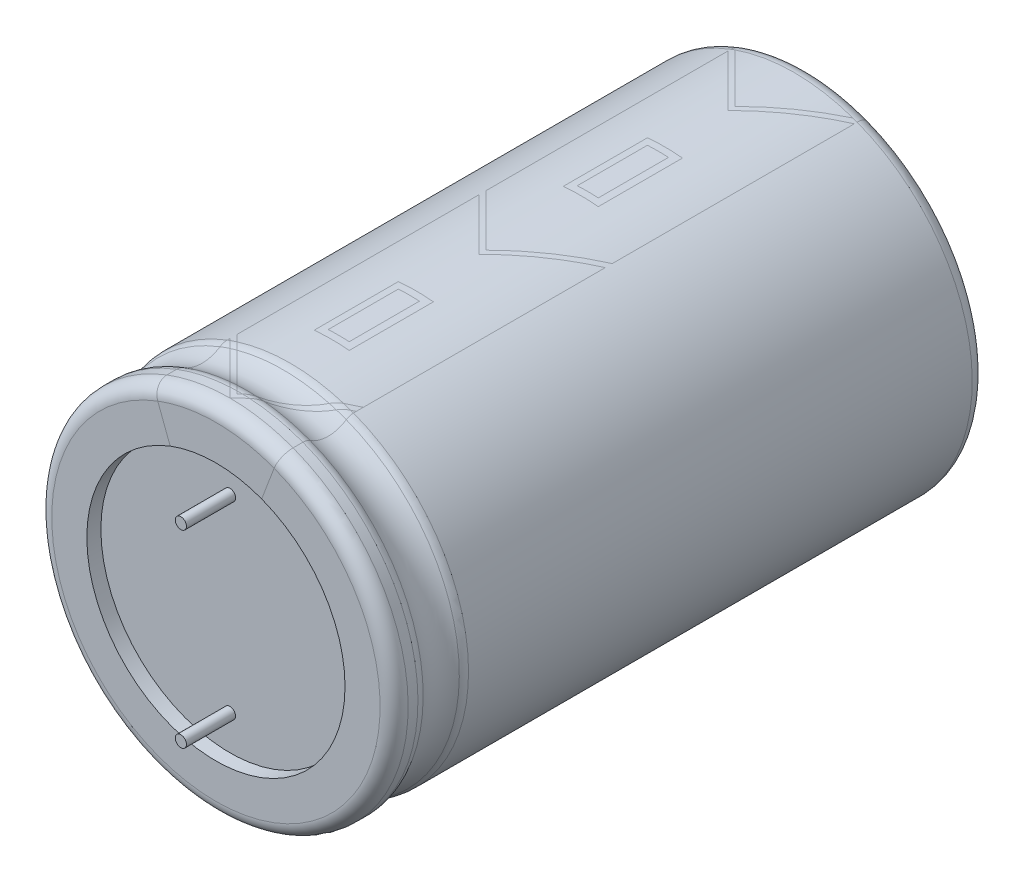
from build123d import *

# Parameters (mm, degrees)
SZKIC2_R                    = 9.2
WYTNIJ_WYCI_GNI_CIE1_DEPTH  = 1
DODANIE_WYCI_GNI_CIE1_START = 0.9
SZKIC3_R                    = 9.2
DODANIE_WYCI_GNI_CIE1_DEPTH = 0.9
WYTNIJ_WYCI_GNI_CIE2_START  = -1
SZKIC4_R                    = 9.2
WYTNIJ_WYCI_GNI_CIE2_DEPTH  = 1
SZKIC5_W                    = 0.2
SZKIC5_H                    = 9
WYTNIJ_WYCI_GNI_CIE3_DEPTH  = 0.2
SZYK_KO_OWY1_COUNT          = 4
SZKIC14_R                   = 0.4
DODANIE_WYCI_GNI_CIE2_DEPTH = 3.5


with BuildPart() as part:
    # Szkic1 → Obr_t1 (revolve)
    with BuildSketch(Plane(origin=(0, 0, 0), x_dir=(1, 0, 0), z_dir=(0, 1, 0))):
        with BuildLine():
            Line((0, 0), (0, 42.2))
            Line((0, 42.2), (11.7, 42.2))
            ThreePointArc((11.7, 42.2), (12.407106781, 41.907106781), (12.7, 41.2))
            Line((12.7, 41.2), (12.7, 5.302775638))
            ThreePointArc((12.7, 5.302775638), (12.663624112, 5.035514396), (12.557142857, 4.787696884))
            ThreePointArc((12.557142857, 4.787696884), (12.2, 3.5), (12.557142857, 2.212303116))
            ThreePointArc((12.557142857, 2.212303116), (12.663624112, 1.964485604), (12.7, 1.697224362))
            Line((12.7, 1.697224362), (12.7, 1))
            ThreePointArc((12.7, 1), (12.407106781, 0.292893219), (11.7, 0))
            Line((11.7, 0), (0, 0))
        make_face()
    revolve(axis=Axis((0, 0, 0), (0, 0, -1)))

    # Szkic2 → Wytnij-wyci_gni_cie1 (cut)
    with BuildSketch(Plane(origin=(0, 0, -42.2), x_dir=(-1, 0, 0), z_dir=(0, 0, -1))):
        Circle(SZKIC2_R)
    extrude(amount=-WYTNIJ_WYCI_GNI_CIE1_DEPTH, mode=Mode.SUBTRACT)

    # Szkic3 → Dodanie-wyci_gni_cie1 (add)
    with BuildSketch(Plane(origin=(0, 0, -41.2), x_dir=(-1, 0, 0), z_dir=(0, 0, -1)).offset(DODANIE_WYCI_GNI_CIE1_START)):
        Circle(SZKIC3_R)
    extrude(amount=-DODANIE_WYCI_GNI_CIE1_DEPTH)

    # Szkic4 → Wytnij-wyci_gni_cie2 (cut)
    with BuildSketch(Plane.XY.offset(WYTNIJ_WYCI_GNI_CIE2_START)):
        with Locations(Location((0, 0, 0), (0, 0, 180))):
            Circle(SZKIC4_R)
    extrude(amount=WYTNIJ_WYCI_GNI_CIE2_DEPTH, mode=Mode.SUBTRACT)

    # Szkic5 → Wytnij-wyci_gni_cie3 (cut)
    with BuildSketch(Plane(origin=(0, 0, -42.1), x_dir=(-1, 0, 0), z_dir=(0, 0, -1))):
        with Locations((0, 4.5)):
            Rectangle(SZKIC5_W, SZKIC5_H)
    wytnij_wyci_gni_cie3 = extrude(amount=-WYTNIJ_WYCI_GNI_CIE3_DEPTH, mode=Mode.SUBTRACT)

    # Szyk ko_owy1: Wytnij-wyci_gni_cie3 ×4 about axis
    szyk_ko_owy1_axis = Axis((0, 0, 0), (0, 0, -1))
    for i in range(1, SZYK_KO_OWY1_COUNT):
        add(wytnij_wyci_gni_cie3.rotate(szyk_ko_owy1_axis, i * 360 / SZYK_KO_OWY1_COUNT), mode=Mode.SUBTRACT)

    # Szkic14 → Dodanie-wyci_gni_cie2 (add)
    with BuildSketch(Plane.XY.offset(-1)):
        with Locations((0, 6.73)):
            Circle(SZKIC14_R)
        with Locations((0, -6.73)):
            Circle(SZKIC14_R)
    extrude(amount=DODANIE_WYCI_GNI_CIE2_DEPTH)


solid = part.part
